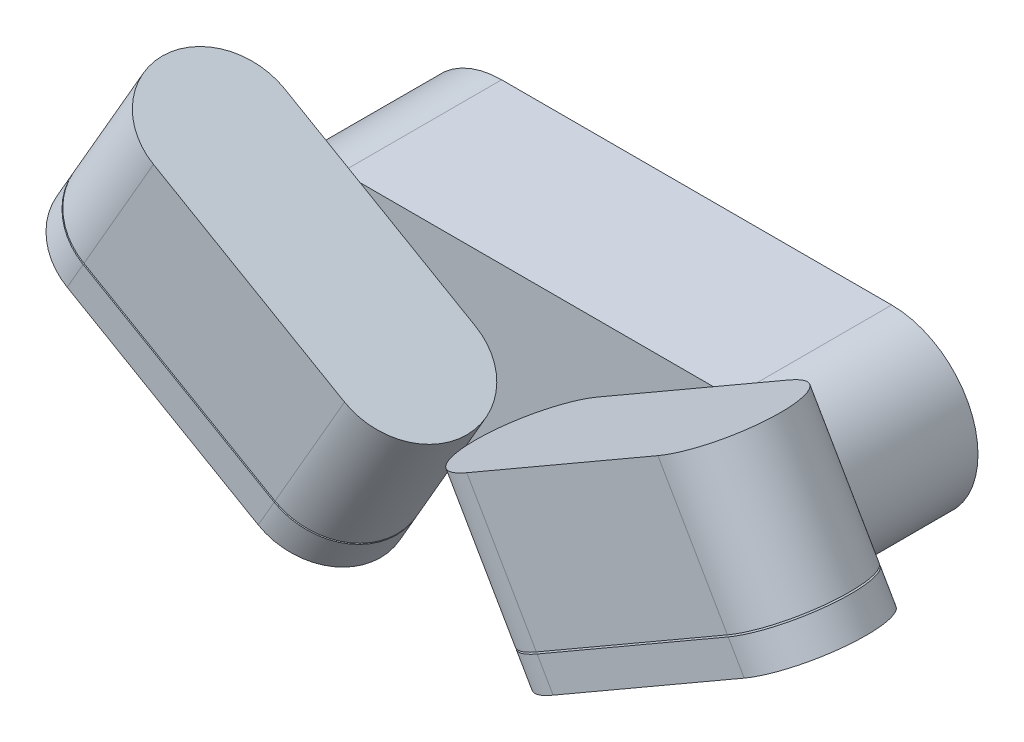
ISO-10303-21;
HEADER;
FILE_DESCRIPTION(('STEP AP214'),'2;1');
FILE_NAME('part.step','',(''),(''),'','','');
FILE_SCHEMA(('AUTOMOTIVE_DESIGN { 1 0 10303 214 1 1 1 1 }'));
ENDSEC;
DATA;
#1=APPLICATION_CONTEXT('core data for automotive mechanical design processes');
#2=APPLICATION_PROTOCOL_DEFINITION('international standard','automotive_design',2000,#1);
#3=PRODUCT_CONTEXT('',#1,'mechanical');
#4=PRODUCT('Part','Part','',(#3));
#5=PRODUCT_RELATED_PRODUCT_CATEGORY('part','',(#4));
#6=PRODUCT_DEFINITION_FORMATION('','',#4);
#7=PRODUCT_DEFINITION_CONTEXT('part definition',#1,'design');
#8=PRODUCT_DEFINITION('design','',#6,#7);
#9=PRODUCT_DEFINITION_SHAPE('','',#8);
#10=(LENGTH_UNIT() NAMED_UNIT(*) SI_UNIT(.MILLI.,.METRE.));
#11=(NAMED_UNIT(*) PLANE_ANGLE_UNIT() SI_UNIT($,.RADIAN.));
#12=(NAMED_UNIT(*) SI_UNIT($,.STERADIAN.) SOLID_ANGLE_UNIT());
#13=UNCERTAINTY_MEASURE_WITH_UNIT(LENGTH_MEASURE(1.E-05),#10,'distance_accuracy_value','');
#14=(GEOMETRIC_REPRESENTATION_CONTEXT(3) GLOBAL_UNCERTAINTY_ASSIGNED_CONTEXT((#13)) GLOBAL_UNIT_ASSIGNED_CONTEXT((#10,
#11,#12)) REPRESENTATION_CONTEXT('',''));
#15=CARTESIAN_POINT('',(0.,0.,0.));
#16=DIRECTION('',(0.,0.,1.));
#17=DIRECTION('',(1.,0.,0.));
#18=AXIS2_PLACEMENT_3D('',#15,#16,#17);
#19=CARTESIAN_POINT('',(0.,0.,50.));
#20=DIRECTION('',(0.,0.,1.));
#21=DIRECTION('',(-1.,0.,0.));
#22=AXIS2_PLACEMENT_3D('',#19,#20,#21);
#23=PLANE('',#22);
#24=DIRECTION('',(-0.866025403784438,-0.5,0.));
#25=VECTOR('',#24,1.);
#26=CARTESIAN_POINT('',(100.627876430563,2.96058083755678,50.));
#27=LINE('',#26,#25);
#28=CARTESIAN_POINT('',(48.7346281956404,-27.,50.));
#29=VERTEX_POINT('',#28);
#30=CARTESIAN_POINT('',(40.8721235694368,-31.5394191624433,50.));
#31=VERTEX_POINT('',#30);
#32=EDGE_CURVE('E397',#29,#31,#27,.T.);
#33=ORIENTED_EDGE('',*,*,#32,.T.);
#34=DIRECTION('',(0.5,-0.866025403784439,0.));
#35=VECTOR('',#34,1.);
#36=CARTESIAN_POINT('',(-36.3760467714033,102.258336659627,50.));
#37=LINE('',#36,#35);
#38=CARTESIAN_POINT('',(38.2512886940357,-27.,50.));
#39=VERTEX_POINT('',#38);
#40=EDGE_CURVE('E465',#39,#31,#37,.T.);
#41=ORIENTED_EDGE('',*,*,#40,.F.);
#42=DIRECTION('',(1.,0.,0.));
#43=VECTOR('',#42,1.);
#44=CARTESIAN_POINT('',(-61.,-27.,50.));
#45=LINE('',#44,#43);
#46=EDGE_CURVE('E480',#39,#29,#45,.T.);
#47=ORIENTED_EDGE('',*,*,#46,.T.);
#48=EDGE_LOOP('',(#33,#41,#47));
#49=FACE_BOUND('',#48,.T.);
#50=ADVANCED_FACE('F115',(#49),#23,.F.);
#51=CARTESIAN_POINT('',(100.627876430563,2.96058083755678,50.));
#52=VERTEX_POINT('',#51);
#53=CARTESIAN_POINT('',(87.6132774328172,-4.55340139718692,50.));
#54=VERTEX_POINT('',#53);
#55=EDGE_CURVE('E399',#52,#54,#27,.T.);
#56=ORIENTED_EDGE('',*,*,#55,.T.);
#57=CARTESIAN_POINT('',(61.,0.,50.));
#58=DIRECTION('',(0.,0.,1.));
#59=DIRECTION('',(-1.,0.,0.));
#60=AXIS2_PLACEMENT_3D('',#57,#58,#59);
#61=CIRCLE('',#60,27.);
#62=CARTESIAN_POINT('',(61.,27.,50.));
#63=VERTEX_POINT('',#62);
#64=EDGE_CURVE('E632',#54,#63,#61,.T.);
#65=ORIENTED_EDGE('',*,*,#64,.T.);
#66=DIRECTION('',(-1.,0.,0.));
#67=VECTOR('',#66,1.);
#68=CARTESIAN_POINT('',(-61.,27.,50.));
#69=LINE('',#68,#67);
#70=CARTESIAN_POINT('',(55.2653718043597,27.,50.));
#71=VERTEX_POINT('',#70);
#72=EDGE_CURVE('E639',#63,#71,#69,.T.);
#73=ORIENTED_EDGE('',*,*,#72,.T.);
#74=DIRECTION('',(0.866025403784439,0.5,0.));
#75=VECTOR('',#74,1.);
#76=CARTESIAN_POINT('',(2.12500000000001,-3.68060796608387,50.));
#77=LINE('',#76,#75);
#78=CARTESIAN_POINT('',(78.8778764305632,40.6326859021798,50.));
#79=VERTEX_POINT('',#78);
#80=EDGE_CURVE('E477',#71,#79,#77,.T.);
#81=ORIENTED_EDGE('',*,*,#80,.T.);
#82=DIRECTION('',(0.5,-0.866025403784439,0.));
#83=VECTOR('',#82,1.);
#84=CARTESIAN_POINT('',(23.3797060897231,136.758336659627,50.));
#85=LINE('',#84,#83);
#86=EDGE_CURVE('E431',#79,#52,#85,.T.);
#87=ORIENTED_EDGE('',*,*,#86,.T.);
#88=EDGE_LOOP('',(#56,#65,#73,#81,#87));
#89=FACE_BOUND('',#88,.T.);
#90=ADVANCED_FACE('F765',(#89),#23,.F.);
#91=CARTESIAN_POINT('',(0.,0.,91.));
#92=DIRECTION('',(0.,0.,1.));
#93=DIRECTION('',(-1.,0.,0.));
#94=AXIS2_PLACEMENT_3D('',#91,#92,#93);
#95=PLANE('',#94);
#96=DIRECTION('',(0.5,-0.866025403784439,0.));
#97=VECTOR('',#96,1.);
#98=CARTESIAN_POINT('',(-36.3760467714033,102.258336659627,91.));
#99=LINE('',#98,#97);
#100=CARTESIAN_POINT('',(19.1221235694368,6.13268590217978,91.));
#101=VERTEX_POINT('',#100);
#102=CARTESIAN_POINT('',(40.8721235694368,-31.5394191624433,91.));
#103=VERTEX_POINT('',#102);
#104=EDGE_CURVE('E437',#101,#103,#99,.T.);
#105=ORIENTED_EDGE('',*,*,#104,.T.);
#106=DIRECTION('',(0.866025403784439,0.5,0.));
#107=VECTOR('',#106,1.);
#108=CARTESIAN_POINT('',(40.8721235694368,-31.5394191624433,91.));
#109=LINE('',#108,#107);
#110=CARTESIAN_POINT('',(100.627876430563,2.96058083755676,91.));
#111=VERTEX_POINT('',#110);
#112=EDGE_CURVE('E408',#103,#111,#109,.T.);
#113=ORIENTED_EDGE('',*,*,#112,.T.);
#114=DIRECTION('',(0.5,-0.866025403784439,0.));
#115=VECTOR('',#114,1.);
#116=CARTESIAN_POINT('',(23.3797060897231,136.758336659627,91.));
#117=LINE('',#116,#115);
#118=CARTESIAN_POINT('',(78.8778764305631,40.6326859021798,91.));
#119=VERTEX_POINT('',#118);
#120=EDGE_CURVE('E445',#119,#111,#117,.T.);
#121=ORIENTED_EDGE('',*,*,#120,.F.);
#122=DIRECTION('',(0.866025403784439,0.5,0.));
#123=VECTOR('',#122,1.);
#124=CARTESIAN_POINT('',(2.12500000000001,-3.68060796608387,91.));
#125=LINE('',#124,#123);
#126=EDGE_CURVE('E139',#101,#119,#125,.T.);
#127=ORIENTED_EDGE('',*,*,#126,.F.);
#128=EDGE_LOOP('',(#105,#113,#121,#127));
#129=FACE_BOUND('',#128,.T.);
#130=ADVANCED_FACE('F785',(#129),#95,.T.);
#131=CARTESIAN_POINT('',(23.379706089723,136.758336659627,70.5));
#132=DIRECTION('',(0.5,-0.866025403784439,0.));
#133=DIRECTION('',(0.866025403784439,0.5,0.));
#134=AXIS2_PLACEMENT_3D('',#131,#132,#133);
#135=CYLINDRICAL_SURFACE('',#134,20.5);
#136=CARTESIAN_POINT('',(100.627876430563,2.96058083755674,70.5));
#137=DIRECTION('',(-0.5,0.866025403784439,0.));
#138=DIRECTION('',(-0.866025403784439,-0.5,0.));
#139=AXIS2_PLACEMENT_3D('',#136,#137,#138);
#140=CIRCLE('',#139,20.5);
#141=EDGE_CURVE('E403',#111,#52,#140,.T.);
#142=ORIENTED_EDGE('',*,*,#141,.T.);
#143=ORIENTED_EDGE('',*,*,#86,.F.);
#144=CARTESIAN_POINT('',(78.8778764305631,40.6326859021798,70.5));
#145=DIRECTION('',(0.5,-0.866025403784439,0.));
#146=DIRECTION('',(0.866025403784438,0.5,0.));
#147=AXIS2_PLACEMENT_3D('',#144,#145,#146);
#148=CIRCLE('',#147,20.5);
#149=EDGE_CURVE('E441',#79,#119,#148,.T.);
#150=ORIENTED_EDGE('',*,*,#149,.T.);
#151=ORIENTED_EDGE('',*,*,#120,.T.);
#152=EDGE_LOOP('',(#142,#143,#150,#151));
#153=FACE_BOUND('',#152,.T.);
#154=ADVANCED_FACE('F796',(#153),#135,.T.);
#155=CARTESIAN_POINT('',(-36.3760467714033,102.258336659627,70.5));
#156=DIRECTION('',(0.5,-0.866025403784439,0.));
#157=DIRECTION('',(0.866025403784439,0.5,0.));
#158=AXIS2_PLACEMENT_3D('',#155,#156,#157);
#159=CYLINDRICAL_SURFACE('',#158,20.5);
#160=CARTESIAN_POINT('',(40.8721235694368,-31.5394191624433,70.5));
#161=DIRECTION('',(-0.5,0.866025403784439,0.));
#162=DIRECTION('',(-0.866025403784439,-0.5,0.));
#163=AXIS2_PLACEMENT_3D('',#160,#161,#162);
#164=CIRCLE('',#163,20.5);
#165=EDGE_CURVE('E393',#31,#103,#164,.T.);
#166=ORIENTED_EDGE('',*,*,#165,.T.);
#167=ORIENTED_EDGE('',*,*,#104,.F.);
#168=CARTESIAN_POINT('',(19.1221235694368,6.13268590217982,70.5));
#169=DIRECTION('',(0.5,-0.866025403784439,0.));
#170=DIRECTION('',(0.866025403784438,0.5,0.));
#171=AXIS2_PLACEMENT_3D('',#168,#169,#170);
#172=CIRCLE('',#171,20.5);
#173=CARTESIAN_POINT('',(19.1221235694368,6.13268590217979,50.));
#174=VERTEX_POINT('',#173);
#175=EDGE_CURVE('E451',#101,#174,#172,.T.);
#176=ORIENTED_EDGE('',*,*,#175,.T.);
#177=EDGE_CURVE('E457',#174,#39,#37,.T.);
#178=ORIENTED_EDGE('',*,*,#177,.T.);
#179=ORIENTED_EDGE('',*,*,#40,.T.);
#180=EDGE_LOOP('',(#166,#167,#176,#178,#179));
#181=FACE_BOUND('',#180,.T.);
#182=ADVANCED_FACE('F718',(#181),#159,.T.);
#183=CARTESIAN_POINT('',(29.125,-50.4459797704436,91.));
#184=DIRECTION('',(-0.5,0.866025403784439,0.));
#185=DIRECTION('',(-0.866025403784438,-0.5,0.));
#186=AXIS2_PLACEMENT_3D('',#183,#184,#185);
#187=PLANE('',#186);
#188=DIRECTION('',(0.866025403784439,0.5,0.));
#189=VECTOR('',#188,1.);
#190=CARTESIAN_POINT('',(29.125,-50.4459797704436,50.));
#191=LINE('',#190,#189);
#192=CARTESIAN_POINT('',(46.1221235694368,-40.6326859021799,50.));
#193=VERTEX_POINT('',#192);
#194=CARTESIAN_POINT('',(105.877876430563,-6.13268590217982,50.));
#195=VERTEX_POINT('',#194);
#196=EDGE_CURVE('E444',#193,#195,#191,.T.);
#197=ORIENTED_EDGE('',*,*,#196,.T.);
#198=CARTESIAN_POINT('',(105.877876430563,-6.13268590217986,70.5));
#199=DIRECTION('',(-0.5,0.866025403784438,0.));
#200=DIRECTION('',(-0.866025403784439,-0.5,0.));
#201=AXIS2_PLACEMENT_3D('',#198,#199,#200);
#202=CIRCLE('',#201,20.5);
#203=CARTESIAN_POINT('',(105.877876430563,-6.13268590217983,91.));
#204=VERTEX_POINT('',#203);
#205=EDGE_CURVE('E446',#204,#195,#202,.T.);
#206=ORIENTED_EDGE('',*,*,#205,.F.);
#207=DIRECTION('',(0.866025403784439,0.5,0.));
#208=VECTOR('',#207,1.);
#209=CARTESIAN_POINT('',(29.125,-50.4459797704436,91.));
#210=LINE('',#209,#208);
#211=CARTESIAN_POINT('',(46.1221235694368,-40.6326859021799,91.));
#212=VERTEX_POINT('',#211);
#213=EDGE_CURVE('E466',#212,#204,#210,.T.);
#214=ORIENTED_EDGE('',*,*,#213,.F.);
#215=CARTESIAN_POINT('',(46.1221235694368,-40.6326859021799,70.5));
#216=DIRECTION('',(-0.5,0.866025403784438,0.));
#217=DIRECTION('',(-0.866025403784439,-0.5,0.));
#218=AXIS2_PLACEMENT_3D('',#215,#216,#217);
#219=CIRCLE('',#218,20.5);
#220=EDGE_CURVE('E435',#193,#212,#219,.T.);
#221=ORIENTED_EDGE('',*,*,#220,.F.);
#222=EDGE_LOOP('',(#197,#206,#214,#221));
#223=FACE_BOUND('',#222,.T.);
#224=ADVANCED_FACE('F776',(#223),#187,.F.);
#225=CARTESIAN_POINT('',(2.12500000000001,-3.68060796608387,91.));
#226=DIRECTION('',(-0.5,0.866025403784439,0.));
#227=DIRECTION('',(-0.866025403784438,-0.5,0.));
#228=AXIS2_PLACEMENT_3D('',#225,#226,#227);
#229=PLANE('',#228);
#230=ORIENTED_EDGE('',*,*,#149,.F.);
#231=ORIENTED_EDGE('',*,*,#80,.F.);
#232=EDGE_CURVE('E470',#174,#71,#77,.T.);
#233=ORIENTED_EDGE('',*,*,#232,.F.);
#234=ORIENTED_EDGE('',*,*,#175,.F.);
#235=ORIENTED_EDGE('',*,*,#126,.T.);
#236=EDGE_LOOP('',(#230,#231,#233,#234,#235));
#237=FACE_BOUND('',#236,.T.);
#238=ADVANCED_FACE('F792',(#237),#229,.T.);
#239=CARTESIAN_POINT('',(41.1221235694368,-31.9724318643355,50.));
#240=VERTEX_POINT('',#239);
#241=EDGE_CURVE('E461',#240,#193,#37,.T.);
#242=ORIENTED_EDGE('',*,*,#241,.F.);
#243=DIRECTION('',(-0.866025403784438,-0.5,0.));
#244=VECTOR('',#243,1.);
#245=CARTESIAN_POINT('',(100.877876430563,2.52756813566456,50.));
#246=LINE('',#245,#244);
#247=CARTESIAN_POINT('',(49.7346281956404,-27.,50.));
#248=VERTEX_POINT('',#247);
#249=EDGE_CURVE('E131',#248,#240,#246,.T.);
#250=ORIENTED_EDGE('',*,*,#249,.F.);
#251=CARTESIAN_POINT('',(61.,-27.,50.));
#252=VERTEX_POINT('',#251);
#253=EDGE_CURVE('E473',#248,#252,#45,.T.);
#254=ORIENTED_EDGE('',*,*,#253,.T.);
#255=CARTESIAN_POINT('',(87.4946800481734,-5.19922389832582,50.));
#256=VERTEX_POINT('',#255);
#257=EDGE_CURVE('E634',#252,#256,#61,.T.);
#258=ORIENTED_EDGE('',*,*,#257,.T.);
#259=CARTESIAN_POINT('',(100.877876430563,2.52756813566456,50.));
#260=VERTEX_POINT('',#259);
#261=EDGE_CURVE('E415',#260,#256,#246,.T.);
#262=ORIENTED_EDGE('',*,*,#261,.F.);
#263=EDGE_CURVE('E436',#260,#195,#85,.T.);
#264=ORIENTED_EDGE('',*,*,#263,.T.);
#265=ORIENTED_EDGE('',*,*,#196,.F.);
#266=EDGE_LOOP('',(#242,#250,#254,#258,#262,#264,#265));
#267=FACE_BOUND('',#266,.T.);
#268=ADVANCED_FACE('F735',(#267),#23,.F.);
#269=DIRECTION('',(0.866025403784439,0.5,0.));
#270=VECTOR('',#269,1.);
#271=CARTESIAN_POINT('',(41.1221235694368,-31.9724318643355,91.));
#272=LINE('',#271,#270);
#273=CARTESIAN_POINT('',(41.1221235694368,-31.9724318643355,91.));
#274=VERTEX_POINT('',#273);
#275=CARTESIAN_POINT('',(100.877876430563,2.52756813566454,91.));
#276=VERTEX_POINT('',#275);
#277=EDGE_CURVE('E398',#274,#276,#272,.T.);
#278=ORIENTED_EDGE('',*,*,#277,.F.);
#279=EDGE_CURVE('E430',#274,#212,#99,.T.);
#280=ORIENTED_EDGE('',*,*,#279,.T.);
#281=ORIENTED_EDGE('',*,*,#213,.T.);
#282=EDGE_CURVE('E450',#276,#204,#117,.T.);
#283=ORIENTED_EDGE('',*,*,#282,.F.);
#284=EDGE_LOOP('',(#278,#280,#281,#283));
#285=FACE_BOUND('',#284,.T.);
#286=ADVANCED_FACE('F782',(#285),#95,.T.);
#287=CARTESIAN_POINT('',(-61.,0.,50.));
#288=DIRECTION('',(0.,0.,1.));
#289=DIRECTION('',(1.,0.,0.));
#290=AXIS2_PLACEMENT_3D('',#287,#288,#289);
#291=PLANE('',#290);
#292=DIRECTION('',(1.,0.,0.));
#293=VECTOR('',#292,1.);
#294=CARTESIAN_POINT('',(-61.,-27.,50.));
#295=LINE('',#294,#293);
#296=CARTESIAN_POINT('',(-38.2512886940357,-27.,50.));
#297=VERTEX_POINT('',#296);
#298=EDGE_CURVE('E626',#297,#39,#295,.T.);
#299=ORIENTED_EDGE('',*,*,#298,.T.);
#300=ORIENTED_EDGE('',*,*,#177,.F.);
#301=ORIENTED_EDGE('',*,*,#232,.T.);
#302=CARTESIAN_POINT('',(-55.2653718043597,27.,50.));
#303=VERTEX_POINT('',#302);
#304=EDGE_CURVE('E644',#71,#303,#69,.T.);
#305=ORIENTED_EDGE('',*,*,#304,.T.);
#306=DIRECTION('',(-0.866025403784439,0.5,0.));
#307=VECTOR('',#306,1.);
#308=CARTESIAN_POINT('',(-2.12500000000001,-3.68060796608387,50.));
#309=LINE('',#308,#307);
#310=CARTESIAN_POINT('',(-19.1221235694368,6.1326859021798,50.));
#311=VERTEX_POINT('',#310);
#312=EDGE_CURVE('E615',#311,#303,#309,.T.);
#313=ORIENTED_EDGE('',*,*,#312,.F.);
#314=DIRECTION('',(-0.5,-0.866025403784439,0.));
#315=VECTOR('',#314,1.);
#316=CARTESIAN_POINT('',(-4.62643455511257,31.2399557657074,50.));
#317=LINE('',#316,#315);
#318=EDGE_CURVE('E576',#311,#297,#317,.T.);
#319=ORIENTED_EDGE('',*,*,#318,.T.);
#320=EDGE_LOOP('',(#299,#300,#301,#305,#313,#319));
#321=FACE_BOUND('',#320,.T.);
#322=ADVANCED_FACE('F698',(#321),#291,.T.);
#323=CARTESIAN_POINT('',(0.,0.,91.));
#324=DIRECTION('',(0.,0.,1.));
#325=DIRECTION('',(1.,0.,0.));
#326=AXIS2_PLACEMENT_3D('',#323,#324,#325);
#327=PLANE('',#326);
#328=DIRECTION('',(-0.5,-0.866025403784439,0.));
#329=VECTOR('',#328,1.);
#330=CARTESIAN_POINT('',(-64.3821874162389,65.7399557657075,91.));
#331=LINE('',#330,#329);
#332=CARTESIAN_POINT('',(-78.8778764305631,40.6326859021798,91.));
#333=VERTEX_POINT('',#332);
#334=CARTESIAN_POINT('',(-100.627876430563,2.96058083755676,91.));
#335=VERTEX_POINT('',#334);
#336=EDGE_CURVE('E570',#333,#335,#331,.T.);
#337=ORIENTED_EDGE('',*,*,#336,.T.);
#338=DIRECTION('',(-0.866025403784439,0.5,0.));
#339=VECTOR('',#338,1.);
#340=CARTESIAN_POINT('',(-40.8721235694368,-31.5394191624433,91.));
#341=LINE('',#340,#339);
#342=CARTESIAN_POINT('',(-40.8721235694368,-31.5394191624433,91.));
#343=VERTEX_POINT('',#342);
#344=EDGE_CURVE('E532',#343,#335,#341,.T.);
#345=ORIENTED_EDGE('',*,*,#344,.F.);
#346=DIRECTION('',(-0.5,-0.866025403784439,0.));
#347=VECTOR('',#346,1.);
#348=CARTESIAN_POINT('',(-4.62643455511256,31.2399557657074,91.));
#349=LINE('',#348,#347);
#350=CARTESIAN_POINT('',(-19.1221235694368,6.1326859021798,91.));
#351=VERTEX_POINT('',#350);
#352=EDGE_CURVE('E597',#351,#343,#349,.T.);
#353=ORIENTED_EDGE('',*,*,#352,.F.);
#354=DIRECTION('',(-0.866025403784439,0.5,0.));
#355=VECTOR('',#354,1.);
#356=CARTESIAN_POINT('',(-2.12500000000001,-3.68060796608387,91.));
#357=LINE('',#356,#355);
#358=EDGE_CURVE('E605',#351,#333,#357,.T.);
#359=ORIENTED_EDGE('',*,*,#358,.T.);
#360=EDGE_LOOP('',(#337,#345,#353,#359));
#361=FACE_BOUND('',#360,.T.);
#362=ADVANCED_FACE('F790',(#361),#327,.T.);
#363=CARTESIAN_POINT('',(0.,0.,50.));
#364=DIRECTION('',(0.,0.,1.));
#365=DIRECTION('',(1.,0.,0.));
#366=AXIS2_PLACEMENT_3D('',#363,#364,#365);
#367=PLANE('',#366);
#368=DIRECTION('',(0.866025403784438,-0.5,0.));
#369=VECTOR('',#368,1.);
#370=CARTESIAN_POINT('',(-100.627876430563,2.96058083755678,50.));
#371=LINE('',#370,#369);
#372=CARTESIAN_POINT('',(-100.627876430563,2.96058083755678,50.));
#373=VERTEX_POINT('',#372);
#374=CARTESIAN_POINT('',(-87.6132774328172,-4.55340139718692,50.));
#375=VERTEX_POINT('',#374);
#376=EDGE_CURVE('E540',#373,#375,#371,.T.);
#377=ORIENTED_EDGE('',*,*,#376,.F.);
#378=DIRECTION('',(-0.5,-0.866025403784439,0.));
#379=VECTOR('',#378,1.);
#380=CARTESIAN_POINT('',(-64.3821874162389,65.7399557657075,50.));
#381=LINE('',#380,#379);
#382=CARTESIAN_POINT('',(-78.8778764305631,40.6326859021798,50.));
#383=VERTEX_POINT('',#382);
#384=EDGE_CURVE('E585',#383,#373,#381,.T.);
#385=ORIENTED_EDGE('',*,*,#384,.F.);
#386=EDGE_CURVE('E584',#303,#383,#309,.T.);
#387=ORIENTED_EDGE('',*,*,#386,.F.);
#388=CARTESIAN_POINT('',(-61.,27.,50.));
#389=VERTEX_POINT('',#388);
#390=EDGE_CURVE('E638',#303,#389,#69,.T.);
#391=ORIENTED_EDGE('',*,*,#390,.T.);
#392=CARTESIAN_POINT('',(-61.,0.,50.));
#393=DIRECTION('',(0.,0.,1.));
#394=DIRECTION('',(1.,0.,0.));
#395=AXIS2_PLACEMENT_3D('',#392,#393,#394);
#396=CIRCLE('',#395,27.);
#397=EDGE_CURVE('E622',#389,#375,#396,.T.);
#398=ORIENTED_EDGE('',*,*,#397,.T.);
#399=EDGE_LOOP('',(#377,#385,#387,#391,#398));
#400=FACE_BOUND('',#399,.T.);
#401=ADVANCED_FACE('F690',(#400),#367,.F.);
#402=CARTESIAN_POINT('',(-48.7346281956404,-27.,50.));
#403=VERTEX_POINT('',#402);
#404=CARTESIAN_POINT('',(-40.8721235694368,-31.5394191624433,50.));
#405=VERTEX_POINT('',#404);
#406=EDGE_CURVE('E539',#403,#405,#371,.T.);
#407=ORIENTED_EDGE('',*,*,#406,.F.);
#408=EDGE_CURVE('E633',#403,#297,#295,.T.);
#409=ORIENTED_EDGE('',*,*,#408,.T.);
#410=EDGE_CURVE('E580',#297,#405,#317,.T.);
#411=ORIENTED_EDGE('',*,*,#410,.T.);
#412=EDGE_LOOP('',(#407,#409,#411));
#413=FACE_BOUND('',#412,.T.);
#414=ADVANCED_FACE('F853',(#413),#367,.F.);
#415=CARTESIAN_POINT('',(-4.62643455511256,31.2399557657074,70.5));
#416=DIRECTION('',(-0.5,-0.866025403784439,0.));
#417=DIRECTION('',(0.866025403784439,-0.5,0.));
#418=AXIS2_PLACEMENT_3D('',#415,#416,#417);
#419=CYLINDRICAL_SURFACE('',#418,20.5);
#420=ORIENTED_EDGE('',*,*,#352,.T.);
#421=CARTESIAN_POINT('',(-40.8721235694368,-31.5394191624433,70.5));
#422=DIRECTION('',(-0.5,-0.866025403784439,0.));
#423=DIRECTION('',(0.866025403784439,-0.5,0.));
#424=AXIS2_PLACEMENT_3D('',#421,#422,#423);
#425=CIRCLE('',#424,20.5);
#426=EDGE_CURVE('E529',#405,#343,#425,.T.);
#427=ORIENTED_EDGE('',*,*,#426,.F.);
#428=ORIENTED_EDGE('',*,*,#410,.F.);
#429=ORIENTED_EDGE('',*,*,#318,.F.);
#430=CARTESIAN_POINT('',(-19.1221235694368,6.1326859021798,70.5));
#431=DIRECTION('',(-0.5,-0.866025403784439,0.));
#432=DIRECTION('',(0.866025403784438,-0.5,0.));
#433=AXIS2_PLACEMENT_3D('',#430,#431,#432);
#434=CIRCLE('',#433,20.5);
#435=EDGE_CURVE('E591',#351,#311,#434,.F.);
#436=ORIENTED_EDGE('',*,*,#435,.F.);
#437=EDGE_LOOP('',(#420,#427,#428,#429,#436));
#438=FACE_BOUND('',#437,.T.);
#439=ADVANCED_FACE('F708',(#438),#419,.T.);
#440=CARTESIAN_POINT('',(-64.3821874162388,65.7399557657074,70.5));
#441=DIRECTION('',(-0.5,-0.866025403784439,0.));
#442=DIRECTION('',(0.866025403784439,-0.5,0.));
#443=AXIS2_PLACEMENT_3D('',#440,#441,#442);
#444=CYLINDRICAL_SURFACE('',#443,20.5);
#445=ORIENTED_EDGE('',*,*,#384,.T.);
#446=CARTESIAN_POINT('',(-100.627876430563,2.96058083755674,70.5));
#447=DIRECTION('',(-0.5,-0.866025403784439,0.));
#448=DIRECTION('',(0.866025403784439,-0.5,0.));
#449=AXIS2_PLACEMENT_3D('',#446,#447,#448);
#450=CIRCLE('',#449,20.5);
#451=EDGE_CURVE('E536',#335,#373,#450,.T.);
#452=ORIENTED_EDGE('',*,*,#451,.F.);
#453=ORIENTED_EDGE('',*,*,#336,.F.);
#454=CARTESIAN_POINT('',(-78.8778764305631,40.6326859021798,70.5));
#455=DIRECTION('',(-0.5,-0.866025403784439,0.));
#456=DIRECTION('',(0.866025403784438,-0.5,0.));
#457=AXIS2_PLACEMENT_3D('',#454,#455,#456);
#458=CIRCLE('',#457,20.5);
#459=EDGE_CURVE('E581',#383,#333,#458,.F.);
#460=ORIENTED_EDGE('',*,*,#459,.F.);
#461=EDGE_LOOP('',(#445,#452,#453,#460));
#462=FACE_BOUND('',#461,.T.);
#463=ADVANCED_FACE('F840',(#462),#444,.T.);
#464=CARTESIAN_POINT('',(-2.12500000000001,-3.68060796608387,91.));
#465=DIRECTION('',(-0.5,-0.866025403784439,0.));
#466=DIRECTION('',(0.866025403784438,-0.5,0.));
#467=AXIS2_PLACEMENT_3D('',#464,#465,#466);
#468=PLANE('',#467);
#469=ORIENTED_EDGE('',*,*,#459,.T.);
#470=ORIENTED_EDGE('',*,*,#358,.F.);
#471=ORIENTED_EDGE('',*,*,#435,.T.);
#472=ORIENTED_EDGE('',*,*,#312,.T.);
#473=ORIENTED_EDGE('',*,*,#386,.T.);
#474=EDGE_LOOP('',(#469,#470,#471,#472,#473));
#475=FACE_BOUND('',#474,.T.);
#476=ADVANCED_FACE('F702',(#475),#468,.F.);
#477=CARTESIAN_POINT('',(-29.125,-50.4459797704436,91.));
#478=DIRECTION('',(-0.5,-0.866025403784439,0.));
#479=DIRECTION('',(0.866025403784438,-0.5,0.));
#480=AXIS2_PLACEMENT_3D('',#477,#478,#479);
#481=PLANE('',#480);
#482=DIRECTION('',(-0.866025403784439,0.5,0.));
#483=VECTOR('',#482,1.);
#484=CARTESIAN_POINT('',(-29.125,-50.4459797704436,91.));
#485=LINE('',#484,#483);
#486=CARTESIAN_POINT('',(-46.1221235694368,-40.6326859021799,91.));
#487=VERTEX_POINT('',#486);
#488=CARTESIAN_POINT('',(-105.877876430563,-6.13268590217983,91.));
#489=VERTEX_POINT('',#488);
#490=EDGE_CURVE('E609',#487,#489,#485,.T.);
#491=ORIENTED_EDGE('',*,*,#490,.T.);
#492=CARTESIAN_POINT('',(-105.877876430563,-6.13268590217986,70.5));
#493=DIRECTION('',(-0.5,-0.866025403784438,0.));
#494=DIRECTION('',(0.866025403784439,-0.5,0.));
#495=AXIS2_PLACEMENT_3D('',#492,#493,#494);
#496=CIRCLE('',#495,20.5);
#497=CARTESIAN_POINT('',(-105.877876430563,-6.13268590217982,50.));
#498=VERTEX_POINT('',#497);
#499=EDGE_CURVE('E586',#489,#498,#496,.T.);
#500=ORIENTED_EDGE('',*,*,#499,.T.);
#501=DIRECTION('',(-0.866025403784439,0.5,0.));
#502=VECTOR('',#501,1.);
#503=CARTESIAN_POINT('',(-29.125,-50.4459797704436,50.));
#504=LINE('',#503,#502);
#505=CARTESIAN_POINT('',(-46.1221235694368,-40.6326859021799,50.));
#506=VERTEX_POINT('',#505);
#507=EDGE_CURVE('E610',#506,#498,#504,.T.);
#508=ORIENTED_EDGE('',*,*,#507,.F.);
#509=CARTESIAN_POINT('',(-46.1221235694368,-40.6326859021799,70.5));
#510=DIRECTION('',(-0.5,-0.866025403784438,0.));
#511=DIRECTION('',(0.866025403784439,-0.5,0.));
#512=AXIS2_PLACEMENT_3D('',#509,#510,#511);
#513=CIRCLE('',#512,20.5);
#514=EDGE_CURVE('E574',#506,#487,#513,.T.);
#515=ORIENTED_EDGE('',*,*,#514,.T.);
#516=EDGE_LOOP('',(#491,#500,#508,#515));
#517=FACE_BOUND('',#516,.T.);
#518=ADVANCED_FACE('F848',(#517),#481,.T.);
#519=DIRECTION('',(-0.866025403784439,0.5,0.));
#520=VECTOR('',#519,1.);
#521=CARTESIAN_POINT('',(-41.1221235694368,-31.9724318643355,91.));
#522=LINE('',#521,#520);
#523=CARTESIAN_POINT('',(-41.1221235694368,-31.9724318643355,91.));
#524=VERTEX_POINT('',#523);
#525=CARTESIAN_POINT('',(-100.877876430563,2.52756813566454,91.));
#526=VERTEX_POINT('',#525);
#527=EDGE_CURVE('E549',#524,#526,#522,.T.);
#528=ORIENTED_EDGE('',*,*,#527,.T.);
#529=EDGE_CURVE('E575',#526,#489,#331,.T.);
#530=ORIENTED_EDGE('',*,*,#529,.T.);
#531=ORIENTED_EDGE('',*,*,#490,.F.);
#532=EDGE_CURVE('E601',#524,#487,#349,.T.);
#533=ORIENTED_EDGE('',*,*,#532,.F.);
#534=EDGE_LOOP('',(#528,#530,#531,#533));
#535=FACE_BOUND('',#534,.T.);
#536=ADVANCED_FACE('F844',(#535),#327,.T.);
#537=CARTESIAN_POINT('',(-100.877876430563,2.52756813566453,50.));
#538=VERTEX_POINT('',#537);
#539=EDGE_CURVE('E590',#538,#498,#381,.T.);
#540=ORIENTED_EDGE('',*,*,#539,.F.);
#541=DIRECTION('',(0.866025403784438,-0.5,0.));
#542=VECTOR('',#541,1.);
#543=CARTESIAN_POINT('',(-100.877876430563,2.52756813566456,50.));
#544=LINE('',#543,#542);
#545=CARTESIAN_POINT('',(-87.4946800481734,-5.19922389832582,50.));
#546=VERTEX_POINT('',#545);
#547=EDGE_CURVE('E533',#538,#546,#544,.T.);
#548=ORIENTED_EDGE('',*,*,#547,.T.);
#549=CARTESIAN_POINT('',(-61.,-27.,50.));
#550=VERTEX_POINT('',#549);
#551=EDGE_CURVE('E627',#546,#550,#396,.T.);
#552=ORIENTED_EDGE('',*,*,#551,.T.);
#553=CARTESIAN_POINT('',(-49.7346281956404,-27.,50.));
#554=VERTEX_POINT('',#553);
#555=EDGE_CURVE('E628',#550,#554,#295,.T.);
#556=ORIENTED_EDGE('',*,*,#555,.T.);
#557=CARTESIAN_POINT('',(-41.1221235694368,-31.9724318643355,50.));
#558=VERTEX_POINT('',#557);
#559=EDGE_CURVE('E557',#554,#558,#544,.T.);
#560=ORIENTED_EDGE('',*,*,#559,.T.);
#561=EDGE_CURVE('E569',#558,#506,#317,.T.);
#562=ORIENTED_EDGE('',*,*,#561,.T.);
#563=ORIENTED_EDGE('',*,*,#507,.T.);
#564=EDGE_LOOP('',(#540,#548,#552,#556,#560,#562,#563));
#565=FACE_BOUND('',#564,.T.);
#566=ADVANCED_FACE('F847',(#565),#367,.F.);
#567=CARTESIAN_POINT('',(-61.,0.,50.));
#568=DIRECTION('',(0.,0.,-1.));
#569=DIRECTION('',(-1.,0.,0.));
#570=AXIS2_PLACEMENT_3D('',#567,#568,#569);
#571=CYLINDRICAL_SURFACE('',#570,27.);
#572=CARTESIAN_POINT('',(-61.,0.,0.));
#573=DIRECTION('',(0.,0.,1.));
#574=DIRECTION('',(1.,0.,0.));
#575=AXIS2_PLACEMENT_3D('',#572,#573,#574);
#576=CIRCLE('',#575,27.);
#577=CARTESIAN_POINT('',(-61.,27.,0.));
#578=VERTEX_POINT('',#577);
#579=CARTESIAN_POINT('',(-61.,-27.,0.));
#580=VERTEX_POINT('',#579);
#581=EDGE_CURVE('E614',#578,#580,#576,.T.);
#582=ORIENTED_EDGE('',*,*,#581,.T.);
#583=DIRECTION('',(0.,0.,-1.));
#584=VECTOR('',#583,1.);
#585=CARTESIAN_POINT('',(-61.,-27.,50.));
#586=LINE('',#585,#584);
#587=EDGE_CURVE('E12',#550,#580,#586,.T.);
#588=ORIENTED_EDGE('',*,*,#587,.F.);
#589=ORIENTED_EDGE('',*,*,#551,.F.);
#590=CARTESIAN_POINT('',(-61.,0.,50.));
#591=DIRECTION('',(0.,0.,-1.));
#592=DIRECTION('',(-1.,0.,0.));
#593=AXIS2_PLACEMENT_3D('',#590,#591,#592);
#594=CIRCLE('',#593,27.);
#595=EDGE_CURVE('E565',#546,#375,#594,.T.);
#596=ORIENTED_EDGE('',*,*,#595,.T.);
#597=ORIENTED_EDGE('',*,*,#397,.F.);
#598=DIRECTION('',(0.,0.,-1.));
#599=VECTOR('',#598,1.);
#600=CARTESIAN_POINT('',(-61.,27.,50.));
#601=LINE('',#600,#599);
#602=EDGE_CURVE('E643',#389,#578,#601,.T.);
#603=ORIENTED_EDGE('',*,*,#602,.T.);
#604=EDGE_LOOP('',(#582,#588,#589,#596,#597,#603));
#605=FACE_BOUND('',#604,.T.);
#606=ADVANCED_FACE('F117',(#605),#571,.T.);
#607=CARTESIAN_POINT('',(-61.,-27.,50.));
#608=DIRECTION('',(0.,1.,0.));
#609=DIRECTION('',(0.,0.,1.));
#610=AXIS2_PLACEMENT_3D('',#607,#608,#609);
#611=PLANE('',#610);
#612=DIRECTION('',(1.,0.,0.));
#613=VECTOR('',#612,1.);
#614=CARTESIAN_POINT('',(-61.,-27.,0.));
#615=LINE('',#614,#613);
#616=CARTESIAN_POINT('',(61.,-27.,0.));
#617=VERTEX_POINT('',#616);
#618=EDGE_CURVE('E648',#580,#617,#615,.T.);
#619=ORIENTED_EDGE('',*,*,#618,.T.);
#620=DIRECTION('',(0.,0.,-1.));
#621=VECTOR('',#620,1.);
#622=CARTESIAN_POINT('',(61.,-27.,50.));
#623=LINE('',#622,#621);
#624=EDGE_CURVE('E124',#252,#617,#623,.T.);
#625=ORIENTED_EDGE('',*,*,#624,.F.);
#626=ORIENTED_EDGE('',*,*,#253,.F.);
#627=DIRECTION('',(1.,0.,0.));
#628=VECTOR('',#627,1.);
#629=CARTESIAN_POINT('',(-61.,-27.,50.));
#630=LINE('',#629,#628);
#631=EDGE_CURVE('E427',#29,#248,#630,.T.);
#632=ORIENTED_EDGE('',*,*,#631,.F.);
#633=ORIENTED_EDGE('',*,*,#46,.F.);
#634=ORIENTED_EDGE('',*,*,#298,.F.);
#635=ORIENTED_EDGE('',*,*,#408,.F.);
#636=DIRECTION('',(-1.,0.,0.));
#637=VECTOR('',#636,1.);
#638=CARTESIAN_POINT('',(-61.,-27.,50.));
#639=LINE('',#638,#637);
#640=EDGE_CURVE('E544',#403,#554,#639,.T.);
#641=ORIENTED_EDGE('',*,*,#640,.T.);
#642=ORIENTED_EDGE('',*,*,#555,.F.);
#643=ORIENTED_EDGE('',*,*,#587,.T.);
#644=EDGE_LOOP('',(#619,#625,#626,#632,#633,#634,#635,#641,#642,#643));
#645=FACE_BOUND('',#644,.T.);
#646=ADVANCED_FACE('F724',(#645),#611,.F.);
#647=CARTESIAN_POINT('',(61.,0.,50.));
#648=DIRECTION('',(0.,0.,-1.));
#649=DIRECTION('',(-1.,0.,0.));
#650=AXIS2_PLACEMENT_3D('',#647,#648,#649);
#651=CYLINDRICAL_SURFACE('',#650,27.);
#652=CARTESIAN_POINT('',(61.,0.,0.));
#653=DIRECTION('',(0.,0.,1.));
#654=DIRECTION('',(-1.,0.,0.));
#655=AXIS2_PLACEMENT_3D('',#652,#653,#654);
#656=CIRCLE('',#655,27.);
#657=CARTESIAN_POINT('',(61.,27.,0.));
#658=VERTEX_POINT('',#657);
#659=EDGE_CURVE('E651',#617,#658,#656,.T.);
#660=ORIENTED_EDGE('',*,*,#659,.T.);
#661=DIRECTION('',(0.,0.,-1.));
#662=VECTOR('',#661,1.);
#663=CARTESIAN_POINT('',(61.,27.,50.));
#664=LINE('',#663,#662);
#665=EDGE_CURVE('E660',#63,#658,#664,.T.);
#666=ORIENTED_EDGE('',*,*,#665,.F.);
#667=ORIENTED_EDGE('',*,*,#64,.F.);
#668=CARTESIAN_POINT('',(61.,0.,50.));
#669=DIRECTION('',(0.,0.,1.));
#670=DIRECTION('',(1.,0.,0.));
#671=AXIS2_PLACEMENT_3D('',#668,#669,#670);
#672=CIRCLE('',#671,27.);
#673=EDGE_CURVE('E412',#256,#54,#672,.T.);
#674=ORIENTED_EDGE('',*,*,#673,.F.);
#675=ORIENTED_EDGE('',*,*,#257,.F.);
#676=ORIENTED_EDGE('',*,*,#624,.T.);
#677=EDGE_LOOP('',(#660,#666,#667,#674,#675,#676));
#678=FACE_BOUND('',#677,.T.);
#679=ADVANCED_FACE('F669',(#678),#651,.T.);
#680=CARTESIAN_POINT('',(-61.,27.,50.));
#681=DIRECTION('',(0.,-1.,0.));
#682=DIRECTION('',(0.,0.,-1.));
#683=AXIS2_PLACEMENT_3D('',#680,#681,#682);
#684=PLANE('',#683);
#685=DIRECTION('',(-1.,0.,0.));
#686=VECTOR('',#685,1.);
#687=CARTESIAN_POINT('',(-61.,27.,0.));
#688=LINE('',#687,#686);
#689=EDGE_CURVE('E654',#658,#578,#688,.T.);
#690=ORIENTED_EDGE('',*,*,#689,.T.);
#691=ORIENTED_EDGE('',*,*,#602,.F.);
#692=ORIENTED_EDGE('',*,*,#390,.F.);
#693=ORIENTED_EDGE('',*,*,#304,.F.);
#694=ORIENTED_EDGE('',*,*,#72,.F.);
#695=ORIENTED_EDGE('',*,*,#665,.T.);
#696=EDGE_LOOP('',(#690,#691,#692,#693,#694,#695));
#697=FACE_BOUND('',#696,.T.);
#698=ADVANCED_FACE('F679',(#697),#684,.F.);
#699=CARTESIAN_POINT('',(-61.,0.,0.));
#700=DIRECTION('',(0.,0.,1.));
#701=DIRECTION('',(1.,0.,0.));
#702=AXIS2_PLACEMENT_3D('',#699,#700,#701);
#703=PLANE('',#702);
#704=ORIENTED_EDGE('',*,*,#581,.F.);
#705=ORIENTED_EDGE('',*,*,#689,.F.);
#706=ORIENTED_EDGE('',*,*,#659,.F.);
#707=ORIENTED_EDGE('',*,*,#618,.F.);
#708=EDGE_LOOP('',(#704,#705,#706,#707));
#709=FACE_BOUND('',#708,.T.);
#710=ADVANCED_FACE('F677',(#709),#703,.F.);
#711=CARTESIAN_POINT('',(-41.1221235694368,-31.9724318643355,70.5));
#712=DIRECTION('',(-0.5,-0.866025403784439,0.));
#713=DIRECTION('',(0.866025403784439,-0.5,0.));
#714=AXIS2_PLACEMENT_3D('',#711,#712,#713);
#715=CIRCLE('',#714,20.5);
#716=EDGE_CURVE('E519',#558,#524,#715,.T.);
#717=ORIENTED_EDGE('',*,*,#716,.T.);
#718=ORIENTED_EDGE('',*,*,#532,.T.);
#719=ORIENTED_EDGE('',*,*,#514,.F.);
#720=ORIENTED_EDGE('',*,*,#561,.F.);
#721=EDGE_LOOP('',(#717,#718,#719,#720));
#722=FACE_BOUND('',#721,.T.);
#723=ADVANCED_FACE('F838',(#722),#419,.T.);
#724=CARTESIAN_POINT('',(-100.877876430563,2.52756813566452,70.5));
#725=DIRECTION('',(-0.5,-0.866025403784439,0.));
#726=DIRECTION('',(0.866025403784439,-0.5,0.));
#727=AXIS2_PLACEMENT_3D('',#724,#725,#726);
#728=CIRCLE('',#727,20.5);
#729=EDGE_CURVE('E553',#526,#538,#728,.T.);
#730=ORIENTED_EDGE('',*,*,#729,.T.);
#731=ORIENTED_EDGE('',*,*,#539,.T.);
#732=ORIENTED_EDGE('',*,*,#499,.F.);
#733=ORIENTED_EDGE('',*,*,#529,.F.);
#734=EDGE_LOOP('',(#730,#731,#732,#733));
#735=FACE_BOUND('',#734,.T.);
#736=ADVANCED_FACE('F834',(#735),#444,.T.);
#737=CARTESIAN_POINT('',(-100.627876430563,2.96058083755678,50.));
#738=DIRECTION('',(0.,0.,-1.));
#739=DIRECTION('',(-1.,0.,0.));
#740=AXIS2_PLACEMENT_3D('',#737,#738,#739);
#741=PLANE('',#740);
#742=EDGE_CURVE('E561',#546,#554,#544,.T.);
#743=ORIENTED_EDGE('',*,*,#742,.T.);
#744=ORIENTED_EDGE('',*,*,#640,.F.);
#745=EDGE_CURVE('E545',#375,#403,#371,.T.);
#746=ORIENTED_EDGE('',*,*,#745,.F.);
#747=ORIENTED_EDGE('',*,*,#595,.F.);
#748=EDGE_LOOP('',(#743,#744,#746,#747));
#749=FACE_BOUND('',#748,.T.);
#750=ADVANCED_FACE('F827',(#749),#741,.F.);
#751=CARTESIAN_POINT('',(-40.8721235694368,-31.5394191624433,70.5));
#752=DIRECTION('',(-0.5,-0.866025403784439,0.));
#753=DIRECTION('',(0.866025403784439,-0.5,0.));
#754=AXIS2_PLACEMENT_3D('',#751,#752,#753);
#755=PLANE('',#754);
#756=DIRECTION('',(0.866025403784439,-0.5,0.));
#757=VECTOR('',#756,1.);
#758=CARTESIAN_POINT('',(-100.627876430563,2.96058083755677,55.));
#759=LINE('',#758,#757);
#760=CARTESIAN_POINT('',(-100.627876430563,2.96058083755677,55.));
#761=VERTEX_POINT('',#760);
#762=CARTESIAN_POINT('',(-40.8721235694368,-31.5394191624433,55.));
#763=VERTEX_POINT('',#762);
#764=EDGE_CURVE('E498',#761,#763,#759,.T.);
#765=ORIENTED_EDGE('',*,*,#764,.F.);
#766=CARTESIAN_POINT('',(-100.627876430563,2.96058083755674,70.5));
#767=DIRECTION('',(-0.5,-0.866025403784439,0.));
#768=DIRECTION('',(0.866025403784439,-0.5,0.));
#769=AXIS2_PLACEMENT_3D('',#766,#767,#768);
#770=CIRCLE('',#769,15.5);
#771=CARTESIAN_POINT('',(-100.627876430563,2.96058083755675,86.));
#772=VERTEX_POINT('',#771);
#773=EDGE_CURVE('E494',#772,#761,#770,.T.);
#774=ORIENTED_EDGE('',*,*,#773,.F.);
#775=DIRECTION('',(-0.866025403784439,0.5,0.));
#776=VECTOR('',#775,1.);
#777=CARTESIAN_POINT('',(-40.8721235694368,-31.5394191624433,86.));
#778=LINE('',#777,#776);
#779=CARTESIAN_POINT('',(-40.8721235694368,-31.5394191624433,86.));
#780=VERTEX_POINT('',#779);
#781=EDGE_CURVE('E489',#780,#772,#778,.T.);
#782=ORIENTED_EDGE('',*,*,#781,.F.);
#783=CARTESIAN_POINT('',(-40.8721235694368,-31.5394191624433,70.5));
#784=DIRECTION('',(-0.5,-0.866025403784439,0.));
#785=DIRECTION('',(0.866025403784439,-0.5,0.));
#786=AXIS2_PLACEMENT_3D('',#783,#784,#785);
#787=CIRCLE('',#786,15.5);
#788=EDGE_CURVE('E485',#763,#780,#787,.T.);
#789=ORIENTED_EDGE('',*,*,#788,.F.);
#790=EDGE_LOOP('',(#765,#774,#782,#789));
#791=FACE_BOUND('',#790,.T.);
#792=ORIENTED_EDGE('',*,*,#426,.T.);
#793=ORIENTED_EDGE('',*,*,#344,.T.);
#794=ORIENTED_EDGE('',*,*,#451,.T.);
#795=ORIENTED_EDGE('',*,*,#376,.T.);
#796=ORIENTED_EDGE('',*,*,#745,.T.);
#797=ORIENTED_EDGE('',*,*,#406,.T.);
#798=EDGE_LOOP('',(#792,#793,#794,#795,#796,#797));
#799=FACE_BOUND('',#798,.T.);
#800=ADVANCED_FACE('F824',(#791,#799),#755,.T.);
#801=CARTESIAN_POINT('',(-41.1221235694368,-31.9724318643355,70.5));
#802=DIRECTION('',(-0.5,-0.866025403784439,0.));
#803=DIRECTION('',(0.866025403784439,-0.5,0.));
#804=AXIS2_PLACEMENT_3D('',#801,#802,#803);
#805=PLANE('',#804);
#806=CARTESIAN_POINT('',(-41.1221235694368,-31.9724318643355,70.5));
#807=DIRECTION('',(-0.5,-0.866025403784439,0.));
#808=DIRECTION('',(0.866025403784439,-0.5,0.));
#809=AXIS2_PLACEMENT_3D('',#806,#807,#808);
#810=CIRCLE('',#809,15.5);
#811=CARTESIAN_POINT('',(-41.1221235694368,-31.9724318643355,55.));
#812=VERTEX_POINT('',#811);
#813=CARTESIAN_POINT('',(-41.1221235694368,-31.9724318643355,86.));
#814=VERTEX_POINT('',#813);
#815=EDGE_CURVE('E484',#812,#814,#810,.T.);
#816=ORIENTED_EDGE('',*,*,#815,.T.);
#817=DIRECTION('',(-0.866025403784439,0.5,0.));
#818=VECTOR('',#817,1.);
#819=CARTESIAN_POINT('',(-41.1221235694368,-31.9724318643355,86.));
#820=LINE('',#819,#818);
#821=CARTESIAN_POINT('',(-100.877876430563,2.52756813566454,86.));
#822=VERTEX_POINT('',#821);
#823=EDGE_CURVE('E505',#814,#822,#820,.T.);
#824=ORIENTED_EDGE('',*,*,#823,.T.);
#825=CARTESIAN_POINT('',(-100.877876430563,2.52756813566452,70.5));
#826=DIRECTION('',(-0.5,-0.866025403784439,0.));
#827=DIRECTION('',(0.866025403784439,-0.5,0.));
#828=AXIS2_PLACEMENT_3D('',#825,#826,#827);
#829=CIRCLE('',#828,15.5);
#830=CARTESIAN_POINT('',(-100.877876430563,2.52756813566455,55.));
#831=VERTEX_POINT('',#830);
#832=EDGE_CURVE('E509',#822,#831,#829,.T.);
#833=ORIENTED_EDGE('',*,*,#832,.T.);
#834=DIRECTION('',(0.866025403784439,-0.5,0.));
#835=VECTOR('',#834,1.);
#836=CARTESIAN_POINT('',(-100.877876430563,2.52756813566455,55.));
#837=LINE('',#836,#835);
#838=EDGE_CURVE('E490',#831,#812,#837,.T.);
#839=ORIENTED_EDGE('',*,*,#838,.T.);
#840=EDGE_LOOP('',(#816,#824,#833,#839));
#841=FACE_BOUND('',#840,.T.);
#842=ORIENTED_EDGE('',*,*,#716,.F.);
#843=ORIENTED_EDGE('',*,*,#559,.F.);
#844=ORIENTED_EDGE('',*,*,#742,.F.);
#845=ORIENTED_EDGE('',*,*,#547,.F.);
#846=ORIENTED_EDGE('',*,*,#729,.F.);
#847=ORIENTED_EDGE('',*,*,#527,.F.);
#848=EDGE_LOOP('',(#842,#843,#844,#845,#846,#847));
#849=FACE_BOUND('',#848,.T.);
#850=ADVANCED_FACE('F822',(#841,#849),#805,.F.);
#851=CARTESIAN_POINT('',(-40.8721235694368,-31.5394191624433,70.5));
#852=DIRECTION('',(-0.5,-0.866025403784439,0.));
#853=DIRECTION('',(0.866025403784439,-0.5,0.));
#854=AXIS2_PLACEMENT_3D('',#851,#852,#853);
#855=CYLINDRICAL_SURFACE('',#854,15.5);
#856=ORIENTED_EDGE('',*,*,#815,.F.);
#857=DIRECTION('',(-0.5,-0.866025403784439,0.));
#858=VECTOR('',#857,1.);
#859=CARTESIAN_POINT('',(-40.8721235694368,-31.5394191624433,55.));
#860=LINE('',#859,#858);
#861=EDGE_CURVE('E516',#763,#812,#860,.T.);
#862=ORIENTED_EDGE('',*,*,#861,.F.);
#863=ORIENTED_EDGE('',*,*,#788,.T.);
#864=DIRECTION('',(-0.5,-0.866025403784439,0.));
#865=VECTOR('',#864,1.);
#866=CARTESIAN_POINT('',(-40.8721235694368,-31.5394191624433,86.));
#867=LINE('',#866,#865);
#868=EDGE_CURVE('E502',#780,#814,#867,.T.);
#869=ORIENTED_EDGE('',*,*,#868,.T.);
#870=EDGE_LOOP('',(#856,#862,#863,#869));
#871=FACE_BOUND('',#870,.T.);
#872=ADVANCED_FACE('F811',(#871),#855,.T.);
#873=CARTESIAN_POINT('',(-100.627876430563,2.96058083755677,55.));
#874=DIRECTION('',(0.,0.,-1.));
#875=DIRECTION('',(-1.,0.,0.));
#876=AXIS2_PLACEMENT_3D('',#873,#874,#875);
#877=PLANE('',#876);
#878=ORIENTED_EDGE('',*,*,#838,.F.);
#879=DIRECTION('',(-0.5,-0.866025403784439,0.));
#880=VECTOR('',#879,1.);
#881=CARTESIAN_POINT('',(-100.627876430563,2.96058083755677,55.));
#882=LINE('',#881,#880);
#883=EDGE_CURVE('E520',#761,#831,#882,.T.);
#884=ORIENTED_EDGE('',*,*,#883,.F.);
#885=ORIENTED_EDGE('',*,*,#764,.T.);
#886=ORIENTED_EDGE('',*,*,#861,.T.);
#887=EDGE_LOOP('',(#878,#884,#885,#886));
#888=FACE_BOUND('',#887,.T.);
#889=ADVANCED_FACE('F807',(#888),#877,.T.);
#890=CARTESIAN_POINT('',(-100.627876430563,2.96058083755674,70.5));
#891=DIRECTION('',(-0.5,-0.866025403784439,0.));
#892=DIRECTION('',(0.866025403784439,-0.5,0.));
#893=AXIS2_PLACEMENT_3D('',#890,#891,#892);
#894=CYLINDRICAL_SURFACE('',#893,15.5);
#895=ORIENTED_EDGE('',*,*,#832,.F.);
#896=DIRECTION('',(-0.5,-0.866025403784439,0.));
#897=VECTOR('',#896,1.);
#898=CARTESIAN_POINT('',(-100.627876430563,2.96058083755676,86.));
#899=LINE('',#898,#897);
#900=EDGE_CURVE('E523',#772,#822,#899,.T.);
#901=ORIENTED_EDGE('',*,*,#900,.F.);
#902=ORIENTED_EDGE('',*,*,#773,.T.);
#903=ORIENTED_EDGE('',*,*,#883,.T.);
#904=EDGE_LOOP('',(#895,#901,#902,#903));
#905=FACE_BOUND('',#904,.T.);
#906=ADVANCED_FACE('F810',(#905),#894,.T.);
#907=CARTESIAN_POINT('',(-40.8721235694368,-31.5394191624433,86.));
#908=DIRECTION('',(0.,0.,1.));
#909=DIRECTION('',(1.,0.,0.));
#910=AXIS2_PLACEMENT_3D('',#907,#908,#909);
#911=PLANE('',#910);
#912=ORIENTED_EDGE('',*,*,#823,.F.);
#913=ORIENTED_EDGE('',*,*,#868,.F.);
#914=ORIENTED_EDGE('',*,*,#781,.T.);
#915=ORIENTED_EDGE('',*,*,#900,.T.);
#916=EDGE_LOOP('',(#912,#913,#914,#915));
#917=FACE_BOUND('',#916,.T.);
#918=ADVANCED_FACE('F815',(#917),#911,.T.);
#919=ORIENTED_EDGE('',*,*,#263,.F.);
#920=CARTESIAN_POINT('',(100.877876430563,2.52756813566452,70.5));
#921=DIRECTION('',(-0.5,0.866025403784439,0.));
#922=DIRECTION('',(-0.866025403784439,-0.5,0.));
#923=AXIS2_PLACEMENT_3D('',#920,#921,#922);
#924=CIRCLE('',#923,20.5);
#925=EDGE_CURVE('E419',#276,#260,#924,.T.);
#926=ORIENTED_EDGE('',*,*,#925,.F.);
#927=ORIENTED_EDGE('',*,*,#282,.T.);
#928=ORIENTED_EDGE('',*,*,#205,.T.);
#929=EDGE_LOOP('',(#919,#926,#927,#928));
#930=FACE_BOUND('',#929,.T.);
#931=ADVANCED_FACE('F770',(#930),#135,.T.);
#932=ORIENTED_EDGE('',*,*,#279,.F.);
#933=CARTESIAN_POINT('',(41.1221235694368,-31.9724318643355,70.5));
#934=DIRECTION('',(-0.5,0.866025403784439,0.));
#935=DIRECTION('',(-0.866025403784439,-0.5,0.));
#936=AXIS2_PLACEMENT_3D('',#933,#934,#935);
#937=CIRCLE('',#936,20.5);
#938=EDGE_CURVE('E387',#240,#274,#937,.T.);
#939=ORIENTED_EDGE('',*,*,#938,.F.);
#940=ORIENTED_EDGE('',*,*,#241,.T.);
#941=ORIENTED_EDGE('',*,*,#220,.T.);
#942=EDGE_LOOP('',(#932,#939,#940,#941));
#943=FACE_BOUND('',#942,.T.);
#944=ADVANCED_FACE('F779',(#943),#159,.T.);
#945=CARTESIAN_POINT('',(100.627876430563,2.96058083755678,50.));
#946=DIRECTION('',(0.,0.,1.));
#947=DIRECTION('',(1.,0.,0.));
#948=AXIS2_PLACEMENT_3D('',#945,#946,#947);
#949=PLANE('',#948);
#950=ORIENTED_EDGE('',*,*,#631,.T.);
#951=EDGE_CURVE('E420',#256,#248,#246,.T.);
#952=ORIENTED_EDGE('',*,*,#951,.F.);
#953=ORIENTED_EDGE('',*,*,#673,.T.);
#954=EDGE_CURVE('E404',#54,#29,#27,.T.);
#955=ORIENTED_EDGE('',*,*,#954,.T.);
#956=EDGE_LOOP('',(#950,#952,#953,#955));
#957=FACE_BOUND('',#956,.T.);
#958=ADVANCED_FACE('F727',(#957),#949,.T.);
#959=CARTESIAN_POINT('',(40.8721235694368,-31.5394191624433,70.5));
#960=DIRECTION('',(0.5,-0.866025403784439,0.));
#961=DIRECTION('',(-0.866025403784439,-0.5,0.));
#962=AXIS2_PLACEMENT_3D('',#959,#960,#961);
#963=PLANE('',#962);
#964=ORIENTED_EDGE('',*,*,#165,.F.);
#965=ORIENTED_EDGE('',*,*,#32,.F.);
#966=ORIENTED_EDGE('',*,*,#954,.F.);
#967=ORIENTED_EDGE('',*,*,#55,.F.);
#968=ORIENTED_EDGE('',*,*,#141,.F.);
#969=ORIENTED_EDGE('',*,*,#112,.F.);
#970=EDGE_LOOP('',(#964,#965,#966,#967,#968,#969));
#971=FACE_BOUND('',#970,.T.);
#972=CARTESIAN_POINT('',(40.8721235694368,-31.5394191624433,70.5));
#973=DIRECTION('',(-0.5,0.866025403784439,0.));
#974=DIRECTION('',(-0.866025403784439,-0.5,0.));
#975=AXIS2_PLACEMENT_3D('',#972,#973,#974);
#976=CIRCLE('',#975,15.5);
#977=CARTESIAN_POINT('',(40.8721235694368,-31.5394191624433,55.));
#978=VERTEX_POINT('',#977);
#979=CARTESIAN_POINT('',(40.8721235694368,-31.5394191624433,86.));
#980=VERTEX_POINT('',#979);
#981=EDGE_CURVE('E342',#978,#980,#976,.T.);
#982=ORIENTED_EDGE('',*,*,#981,.T.);
#983=DIRECTION('',(0.866025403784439,0.5,0.));
#984=VECTOR('',#983,1.);
#985=CARTESIAN_POINT('',(40.8721235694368,-31.5394191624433,86.));
#986=LINE('',#985,#984);
#987=CARTESIAN_POINT('',(100.627876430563,2.96058083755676,86.));
#988=VERTEX_POINT('',#987);
#989=EDGE_CURVE('E359',#980,#988,#986,.T.);
#990=ORIENTED_EDGE('',*,*,#989,.T.);
#991=CARTESIAN_POINT('',(100.627876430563,2.96058083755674,70.5));
#992=DIRECTION('',(-0.5,0.866025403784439,0.));
#993=DIRECTION('',(-0.866025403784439,-0.5,0.));
#994=AXIS2_PLACEMENT_3D('',#991,#992,#993);
#995=CIRCLE('',#994,15.5);
#996=CARTESIAN_POINT('',(100.627876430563,2.96058083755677,55.));
#997=VERTEX_POINT('',#996);
#998=EDGE_CURVE('E345',#988,#997,#995,.T.);
#999=ORIENTED_EDGE('',*,*,#998,.T.);
#1000=DIRECTION('',(-0.866025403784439,-0.5,0.));
#1001=VECTOR('',#1000,1.);
#1002=CARTESIAN_POINT('',(100.627876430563,2.96058083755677,55.));
#1003=LINE('',#1002,#1001);
#1004=EDGE_CURVE('E338',#997,#978,#1003,.T.);
#1005=ORIENTED_EDGE('',*,*,#1004,.T.);
#1006=EDGE_LOOP('',(#982,#990,#999,#1005));
#1007=FACE_BOUND('',#1006,.T.);
#1008=ADVANCED_FACE('F340',(#971,#1007),#963,.T.);
#1009=CARTESIAN_POINT('',(41.1221235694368,-31.9724318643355,70.5));
#1010=DIRECTION('',(0.5,-0.866025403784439,0.));
#1011=DIRECTION('',(-0.866025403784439,-0.5,0.));
#1012=AXIS2_PLACEMENT_3D('',#1009,#1010,#1011);
#1013=PLANE('',#1012);
#1014=ORIENTED_EDGE('',*,*,#938,.T.);
#1015=ORIENTED_EDGE('',*,*,#277,.T.);
#1016=ORIENTED_EDGE('',*,*,#925,.T.);
#1017=ORIENTED_EDGE('',*,*,#261,.T.);
#1018=ORIENTED_EDGE('',*,*,#951,.T.);
#1019=ORIENTED_EDGE('',*,*,#249,.T.);
#1020=EDGE_LOOP('',(#1014,#1015,#1016,#1017,#1018,#1019));
#1021=FACE_BOUND('',#1020,.T.);
#1022=DIRECTION('',(-0.866025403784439,-0.5,0.));
#1023=VECTOR('',#1022,1.);
#1024=CARTESIAN_POINT('',(100.877876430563,2.52756813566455,55.));
#1025=LINE('',#1024,#1023);
#1026=CARTESIAN_POINT('',(100.877876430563,2.52756813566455,55.));
#1027=VERTEX_POINT('',#1026);
#1028=CARTESIAN_POINT('',(41.1221235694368,-31.9724318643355,55.));
#1029=VERTEX_POINT('',#1028);
#1030=EDGE_CURVE('E354',#1027,#1029,#1025,.T.);
#1031=ORIENTED_EDGE('',*,*,#1030,.F.);
#1032=CARTESIAN_POINT('',(100.877876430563,2.52756813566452,70.5));
#1033=DIRECTION('',(-0.5,0.866025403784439,0.));
#1034=DIRECTION('',(-0.866025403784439,-0.5,0.));
#1035=AXIS2_PLACEMENT_3D('',#1032,#1033,#1034);
#1036=CIRCLE('',#1035,15.5);
#1037=CARTESIAN_POINT('',(100.877876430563,2.52756813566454,86.));
#1038=VERTEX_POINT('',#1037);
#1039=EDGE_CURVE('E370',#1038,#1027,#1036,.T.);
#1040=ORIENTED_EDGE('',*,*,#1039,.F.);
#1041=DIRECTION('',(0.866025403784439,0.5,0.));
#1042=VECTOR('',#1041,1.);
#1043=CARTESIAN_POINT('',(41.1221235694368,-31.9724318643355,86.));
#1044=LINE('',#1043,#1042);
#1045=CARTESIAN_POINT('',(41.1221235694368,-31.9724318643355,86.));
#1046=VERTEX_POINT('',#1045);
#1047=EDGE_CURVE('E366',#1046,#1038,#1044,.T.);
#1048=ORIENTED_EDGE('',*,*,#1047,.F.);
#1049=CARTESIAN_POINT('',(41.1221235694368,-31.9724318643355,70.5));
#1050=DIRECTION('',(-0.5,0.866025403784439,0.));
#1051=DIRECTION('',(-0.866025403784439,-0.5,0.));
#1052=AXIS2_PLACEMENT_3D('',#1049,#1050,#1051);
#1053=CIRCLE('',#1052,15.5);
#1054=EDGE_CURVE('E377',#1029,#1046,#1053,.T.);
#1055=ORIENTED_EDGE('',*,*,#1054,.F.);
#1056=EDGE_LOOP('',(#1031,#1040,#1048,#1055));
#1057=FACE_BOUND('',#1056,.T.);
#1058=ADVANCED_FACE('F729',(#1021,#1057),#1013,.F.);
#1059=CARTESIAN_POINT('',(40.8721235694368,-31.5394191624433,70.5));
#1060=DIRECTION('',(0.5,-0.866025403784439,0.));
#1061=DIRECTION('',(0.866025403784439,0.5,0.));
#1062=AXIS2_PLACEMENT_3D('',#1059,#1060,#1061);
#1063=CYLINDRICAL_SURFACE('',#1062,15.5);
#1064=ORIENTED_EDGE('',*,*,#1054,.T.);
#1065=DIRECTION('',(0.5,-0.866025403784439,0.));
#1066=VECTOR('',#1065,1.);
#1067=CARTESIAN_POINT('',(40.8721235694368,-31.5394191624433,86.));
#1068=LINE('',#1067,#1066);
#1069=EDGE_CURVE('E363',#980,#1046,#1068,.T.);
#1070=ORIENTED_EDGE('',*,*,#1069,.F.);
#1071=ORIENTED_EDGE('',*,*,#981,.F.);
#1072=DIRECTION('',(0.5,-0.866025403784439,0.));
#1073=VECTOR('',#1072,1.);
#1074=CARTESIAN_POINT('',(40.8721235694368,-31.5394191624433,55.));
#1075=LINE('',#1074,#1073);
#1076=EDGE_CURVE('E351',#978,#1029,#1075,.T.);
#1077=ORIENTED_EDGE('',*,*,#1076,.T.);
#1078=EDGE_LOOP('',(#1064,#1070,#1071,#1077));
#1079=FACE_BOUND('',#1078,.T.);
#1080=ADVANCED_FACE('F361',(#1079),#1063,.T.);
#1081=CARTESIAN_POINT('',(40.8721235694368,-31.5394191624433,86.));
#1082=DIRECTION('',(0.,0.,-1.));
#1083=DIRECTION('',(-1.,0.,0.));
#1084=AXIS2_PLACEMENT_3D('',#1081,#1082,#1083);
#1085=PLANE('',#1084);
#1086=ORIENTED_EDGE('',*,*,#1047,.T.);
#1087=DIRECTION('',(0.5,-0.866025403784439,0.));
#1088=VECTOR('',#1087,1.);
#1089=CARTESIAN_POINT('',(100.627876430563,2.96058083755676,86.));
#1090=LINE('',#1089,#1088);
#1091=EDGE_CURVE('E388',#988,#1038,#1090,.T.);
#1092=ORIENTED_EDGE('',*,*,#1091,.F.);
#1093=ORIENTED_EDGE('',*,*,#989,.F.);
#1094=ORIENTED_EDGE('',*,*,#1069,.T.);
#1095=EDGE_LOOP('',(#1086,#1092,#1093,#1094));
#1096=FACE_BOUND('',#1095,.T.);
#1097=ADVANCED_FACE('F1045',(#1096),#1085,.F.);
#1098=CARTESIAN_POINT('',(100.627876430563,2.96058083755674,70.5));
#1099=DIRECTION('',(0.5,-0.866025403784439,0.));
#1100=DIRECTION('',(0.866025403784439,0.5,0.));
#1101=AXIS2_PLACEMENT_3D('',#1098,#1099,#1100);
#1102=CYLINDRICAL_SURFACE('',#1101,15.5);
#1103=ORIENTED_EDGE('',*,*,#1039,.T.);
#1104=DIRECTION('',(0.5,-0.866025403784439,0.));
#1105=VECTOR('',#1104,1.);
#1106=CARTESIAN_POINT('',(100.627876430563,2.96058083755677,55.));
#1107=LINE('',#1106,#1105);
#1108=EDGE_CURVE('E358',#997,#1027,#1107,.T.);
#1109=ORIENTED_EDGE('',*,*,#1108,.F.);
#1110=ORIENTED_EDGE('',*,*,#998,.F.);
#1111=ORIENTED_EDGE('',*,*,#1091,.T.);
#1112=EDGE_LOOP('',(#1103,#1109,#1110,#1111));
#1113=FACE_BOUND('',#1112,.T.);
#1114=ADVANCED_FACE('F1054',(#1113),#1102,.T.);
#1115=CARTESIAN_POINT('',(100.627876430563,2.96058083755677,55.));
#1116=DIRECTION('',(0.,0.,1.));
#1117=DIRECTION('',(1.,0.,0.));
#1118=AXIS2_PLACEMENT_3D('',#1115,#1116,#1117);
#1119=PLANE('',#1118);
#1120=ORIENTED_EDGE('',*,*,#1030,.T.);
#1121=ORIENTED_EDGE('',*,*,#1076,.F.);
#1122=ORIENTED_EDGE('',*,*,#1004,.F.);
#1123=ORIENTED_EDGE('',*,*,#1108,.T.);
#1124=EDGE_LOOP('',(#1120,#1121,#1122,#1123));
#1125=FACE_BOUND('',#1124,.T.);
#1126=ADVANCED_FACE('F352',(#1125),#1119,.F.);
#1127=CLOSED_SHELL('',(#50,#90,#130,#154,#182,#224,#238,#268,#286,#322,#362,#401,#414,#439,#463,
#476,#518,#536,#566,#606,#646,#679,#698,#710,#723,#736,#750,#800,#850,#872,#889,#906,#918,#931,
#944,#958,#1008,#1058,#1080,#1097,#1114,#1126));
#1128=MANIFOLD_SOLID_BREP('B2',#1127);
#1129=ADVANCED_BREP_SHAPE_REPRESENTATION('',(#18,#1128),#14);
#1130=SHAPE_DEFINITION_REPRESENTATION(#9,#1129);
ENDSEC;
END-ISO-10303-21;
